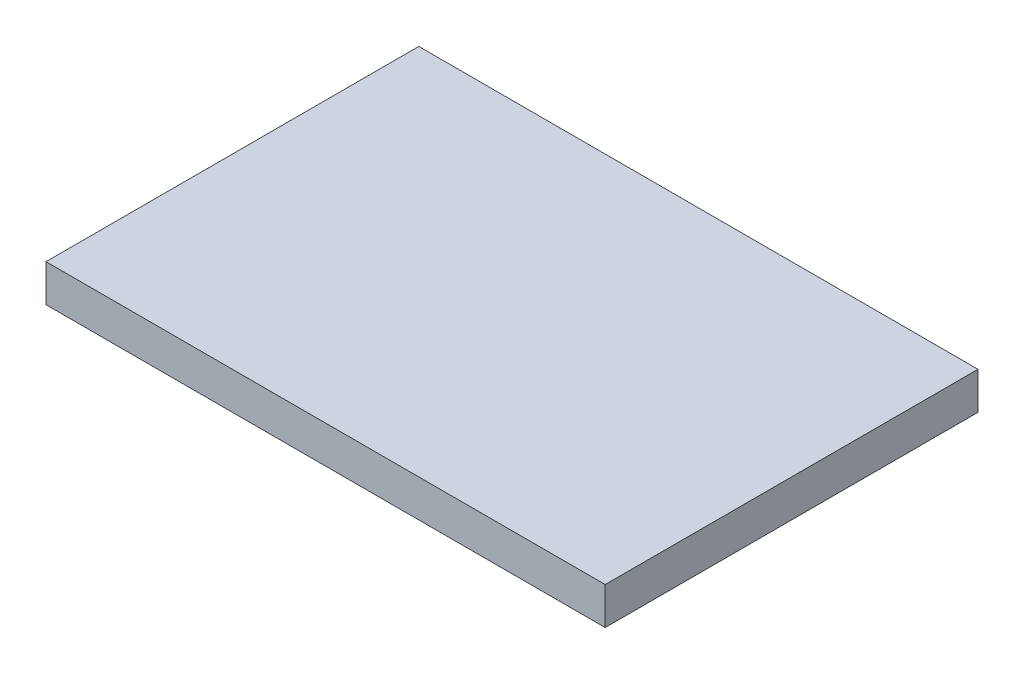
ISO-10303-21;
HEADER;
FILE_DESCRIPTION(('STEP AP214'),'2;1');
FILE_NAME('part.step','',(''),(''),'','','');
FILE_SCHEMA(('AUTOMOTIVE_DESIGN { 1 0 10303 214 1 1 1 1 }'));
ENDSEC;
DATA;
#1=APPLICATION_CONTEXT('core data for automotive mechanical design processes');
#2=APPLICATION_PROTOCOL_DEFINITION('international standard','automotive_design',2000,#1);
#3=PRODUCT_CONTEXT('',#1,'mechanical');
#4=PRODUCT('Part','Part','',(#3));
#5=PRODUCT_RELATED_PRODUCT_CATEGORY('part','',(#4));
#6=PRODUCT_DEFINITION_FORMATION('','',#4);
#7=PRODUCT_DEFINITION_CONTEXT('part definition',#1,'design');
#8=PRODUCT_DEFINITION('design','',#6,#7);
#9=PRODUCT_DEFINITION_SHAPE('','',#8);
#10=(LENGTH_UNIT() NAMED_UNIT(*) SI_UNIT(.MILLI.,.METRE.));
#11=(NAMED_UNIT(*) PLANE_ANGLE_UNIT() SI_UNIT($,.RADIAN.));
#12=(NAMED_UNIT(*) SI_UNIT($,.STERADIAN.) SOLID_ANGLE_UNIT());
#13=UNCERTAINTY_MEASURE_WITH_UNIT(LENGTH_MEASURE(1.E-05),#10,'distance_accuracy_value','');
#14=(GEOMETRIC_REPRESENTATION_CONTEXT(3) GLOBAL_UNCERTAINTY_ASSIGNED_CONTEXT((#13)) GLOBAL_UNIT_ASSIGNED_CONTEXT((#10,
#11,#12)) REPRESENTATION_CONTEXT('',''));
#15=CARTESIAN_POINT('',(0.,0.,0.));
#16=DIRECTION('',(0.,0.,1.));
#17=DIRECTION('',(1.,0.,0.));
#18=AXIS2_PLACEMENT_3D('',#15,#16,#17);
#19=CARTESIAN_POINT('',(-37.5,5.,-25.));
#20=DIRECTION('',(1.,0.,0.));
#21=DIRECTION('',(0.,0.,-1.));
#22=AXIS2_PLACEMENT_3D('',#19,#20,#21);
#23=PLANE('',#22);
#24=DIRECTION('',(0.,0.,1.));
#25=VECTOR('',#24,1.);
#26=CARTESIAN_POINT('',(-37.5,0.,-25.));
#27=LINE('',#26,#25);
#28=CARTESIAN_POINT('',(-37.5,0.,-25.));
#29=VERTEX_POINT('',#28);
#30=CARTESIAN_POINT('',(-37.5,0.,25.));
#31=VERTEX_POINT('',#30);
#32=EDGE_CURVE('E77',#29,#31,#27,.T.);
#33=ORIENTED_EDGE('',*,*,#32,.T.);
#34=DIRECTION('',(0.,-1.,0.));
#35=VECTOR('',#34,1.);
#36=CARTESIAN_POINT('',(-37.5,5.,25.));
#37=LINE('',#36,#35);
#38=CARTESIAN_POINT('',(-37.5,5.,25.));
#39=VERTEX_POINT('',#38);
#40=EDGE_CURVE('E11',#39,#31,#37,.T.);
#41=ORIENTED_EDGE('',*,*,#40,.F.);
#42=DIRECTION('',(0.,0.,1.));
#43=VECTOR('',#42,1.);
#44=CARTESIAN_POINT('',(-37.5,5.,-25.));
#45=LINE('',#44,#43);
#46=CARTESIAN_POINT('',(-37.5,5.,-25.));
#47=VERTEX_POINT('',#46);
#48=EDGE_CURVE('E95',#47,#39,#45,.T.);
#49=ORIENTED_EDGE('',*,*,#48,.F.);
#50=DIRECTION('',(0.,-1.,0.));
#51=VECTOR('',#50,1.);
#52=CARTESIAN_POINT('',(-37.5,5.,-25.));
#53=LINE('',#52,#51);
#54=EDGE_CURVE('E89',#47,#29,#53,.T.);
#55=ORIENTED_EDGE('',*,*,#54,.T.);
#56=EDGE_LOOP('',(#33,#41,#49,#55));
#57=FACE_BOUND('',#56,.T.);
#58=ADVANCED_FACE('F33',(#57),#23,.F.);
#59=CARTESIAN_POINT('',(-37.5,5.,25.));
#60=DIRECTION('',(0.,0.,-1.));
#61=DIRECTION('',(-1.,0.,0.));
#62=AXIS2_PLACEMENT_3D('',#59,#60,#61);
#63=PLANE('',#62);
#64=DIRECTION('',(1.,0.,0.));
#65=VECTOR('',#64,1.);
#66=CARTESIAN_POINT('',(-37.5,0.,25.));
#67=LINE('',#66,#65);
#68=CARTESIAN_POINT('',(37.5,0.,25.));
#69=VERTEX_POINT('',#68);
#70=EDGE_CURVE('E73',#31,#69,#67,.T.);
#71=ORIENTED_EDGE('',*,*,#70,.T.);
#72=DIRECTION('',(0.,-1.,0.));
#73=VECTOR('',#72,1.);
#74=CARTESIAN_POINT('',(37.5,5.,25.));
#75=LINE('',#74,#73);
#76=CARTESIAN_POINT('',(37.5,5.,25.));
#77=VERTEX_POINT('',#76);
#78=EDGE_CURVE('E40',#77,#69,#75,.T.);
#79=ORIENTED_EDGE('',*,*,#78,.F.);
#80=DIRECTION('',(1.,0.,0.));
#81=VECTOR('',#80,1.);
#82=CARTESIAN_POINT('',(-37.5,5.,25.));
#83=LINE('',#82,#81);
#84=EDGE_CURVE('E85',#39,#77,#83,.T.);
#85=ORIENTED_EDGE('',*,*,#84,.F.);
#86=ORIENTED_EDGE('',*,*,#40,.T.);
#87=EDGE_LOOP('',(#71,#79,#85,#86));
#88=FACE_BOUND('',#87,.T.);
#89=ADVANCED_FACE('F84',(#88),#63,.F.);
#90=CARTESIAN_POINT('',(37.5,5.,-25.));
#91=DIRECTION('',(-1.,0.,0.));
#92=DIRECTION('',(0.,0.,1.));
#93=AXIS2_PLACEMENT_3D('',#90,#91,#92);
#94=PLANE('',#93);
#95=DIRECTION('',(0.,0.,-1.));
#96=VECTOR('',#95,1.);
#97=CARTESIAN_POINT('',(37.5,0.,-25.));
#98=LINE('',#97,#96);
#99=CARTESIAN_POINT('',(37.5,0.,-25.));
#100=VERTEX_POINT('',#99);
#101=EDGE_CURVE('E78',#69,#100,#98,.T.);
#102=ORIENTED_EDGE('',*,*,#101,.T.);
#103=DIRECTION('',(0.,-1.,0.));
#104=VECTOR('',#103,1.);
#105=CARTESIAN_POINT('',(37.5,5.,-25.));
#106=LINE('',#105,#104);
#107=CARTESIAN_POINT('',(37.5,5.,-25.));
#108=VERTEX_POINT('',#107);
#109=EDGE_CURVE('E101',#108,#100,#106,.T.);
#110=ORIENTED_EDGE('',*,*,#109,.F.);
#111=DIRECTION('',(0.,0.,-1.));
#112=VECTOR('',#111,1.);
#113=CARTESIAN_POINT('',(37.5,5.,-25.));
#114=LINE('',#113,#112);
#115=EDGE_CURVE('E52',#77,#108,#114,.T.);
#116=ORIENTED_EDGE('',*,*,#115,.F.);
#117=ORIENTED_EDGE('',*,*,#78,.T.);
#118=EDGE_LOOP('',(#102,#110,#116,#117));
#119=FACE_BOUND('',#118,.T.);
#120=ADVANCED_FACE('F104',(#119),#94,.F.);
#121=CARTESIAN_POINT('',(-37.5,5.,-25.));
#122=DIRECTION('',(0.,0.,1.));
#123=DIRECTION('',(1.,0.,0.));
#124=AXIS2_PLACEMENT_3D('',#121,#122,#123);
#125=PLANE('',#124);
#126=DIRECTION('',(-1.,0.,0.));
#127=VECTOR('',#126,1.);
#128=CARTESIAN_POINT('',(-37.5,0.,-25.));
#129=LINE('',#128,#127);
#130=EDGE_CURVE('E93',#100,#29,#129,.T.);
#131=ORIENTED_EDGE('',*,*,#130,.T.);
#132=ORIENTED_EDGE('',*,*,#54,.F.);
#133=DIRECTION('',(-1.,0.,0.));
#134=VECTOR('',#133,1.);
#135=CARTESIAN_POINT('',(-37.5,5.,-25.));
#136=LINE('',#135,#134);
#137=EDGE_CURVE('E47',#108,#47,#136,.T.);
#138=ORIENTED_EDGE('',*,*,#137,.F.);
#139=ORIENTED_EDGE('',*,*,#109,.T.);
#140=EDGE_LOOP('',(#131,#132,#138,#139));
#141=FACE_BOUND('',#140,.T.);
#142=ADVANCED_FACE('F106',(#141),#125,.F.);
#143=CARTESIAN_POINT('',(-37.5,5.,25.));
#144=DIRECTION('',(0.,1.,0.));
#145=DIRECTION('',(0.,0.,1.));
#146=AXIS2_PLACEMENT_3D('',#143,#144,#145);
#147=PLANE('',#146);
#148=ORIENTED_EDGE('',*,*,#48,.T.);
#149=ORIENTED_EDGE('',*,*,#84,.T.);
#150=ORIENTED_EDGE('',*,*,#115,.T.);
#151=ORIENTED_EDGE('',*,*,#137,.T.);
#152=EDGE_LOOP('',(#148,#149,#150,#151));
#153=FACE_BOUND('',#152,.T.);
#154=ADVANCED_FACE('F107',(#153),#147,.T.);
#155=CARTESIAN_POINT('',(-37.5,0.,25.));
#156=DIRECTION('',(0.,1.,0.));
#157=DIRECTION('',(0.,0.,1.));
#158=AXIS2_PLACEMENT_3D('',#155,#156,#157);
#159=PLANE('',#158);
#160=ORIENTED_EDGE('',*,*,#32,.F.);
#161=ORIENTED_EDGE('',*,*,#130,.F.);
#162=ORIENTED_EDGE('',*,*,#101,.F.);
#163=ORIENTED_EDGE('',*,*,#70,.F.);
#164=EDGE_LOOP('',(#160,#161,#162,#163));
#165=FACE_BOUND('',#164,.T.);
#166=ADVANCED_FACE('F74',(#165),#159,.F.);
#167=CLOSED_SHELL('',(#58,#89,#120,#142,#154,#166));
#168=MANIFOLD_SOLID_BREP('B2',#167);
#169=ADVANCED_BREP_SHAPE_REPRESENTATION('',(#18,#168),#14);
#170=SHAPE_DEFINITION_REPRESENTATION(#9,#169);
ENDSEC;
END-ISO-10303-21;
